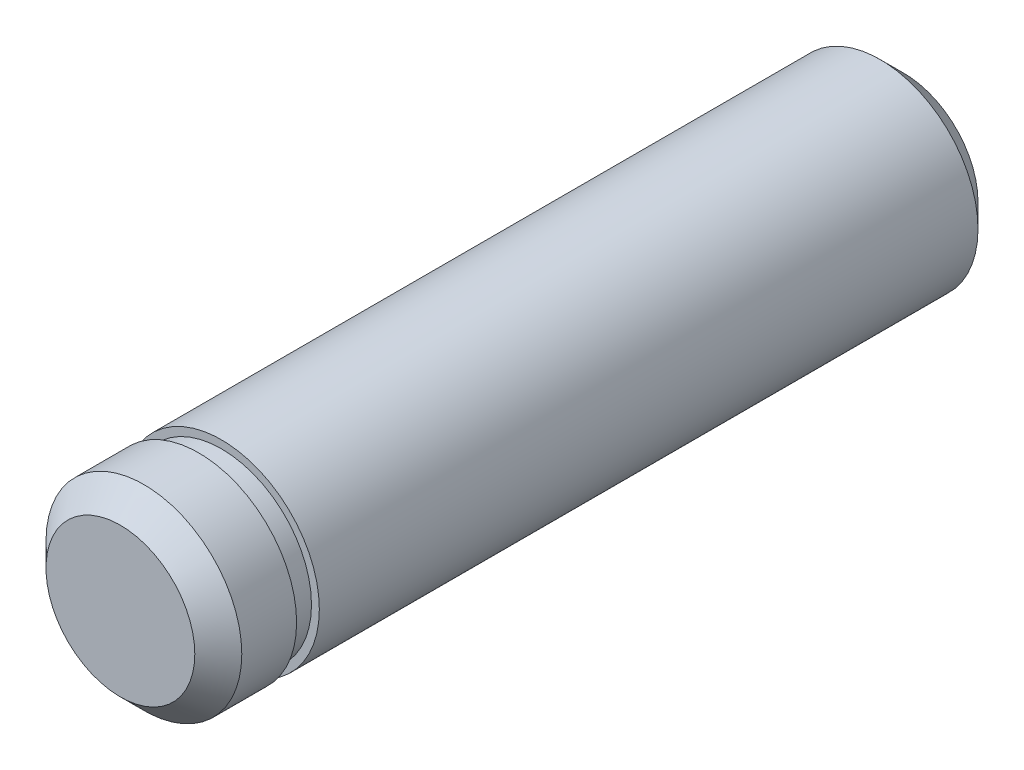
ISO-10303-21;
HEADER;
FILE_DESCRIPTION(('STEP AP214'),'2;1');
FILE_NAME('part.step','',(''),(''),'','','');
FILE_SCHEMA(('AUTOMOTIVE_DESIGN { 1 0 10303 214 1 1 1 1 }'));
ENDSEC;
DATA;
#1=APPLICATION_CONTEXT('core data for automotive mechanical design processes');
#2=APPLICATION_PROTOCOL_DEFINITION('international standard','automotive_design',2000,#1);
#3=PRODUCT_CONTEXT('',#1,'mechanical');
#4=PRODUCT('Part','Part','',(#3));
#5=PRODUCT_RELATED_PRODUCT_CATEGORY('part','',(#4));
#6=PRODUCT_DEFINITION_FORMATION('','',#4);
#7=PRODUCT_DEFINITION_CONTEXT('part definition',#1,'design');
#8=PRODUCT_DEFINITION('design','',#6,#7);
#9=PRODUCT_DEFINITION_SHAPE('','',#8);
#10=(LENGTH_UNIT() NAMED_UNIT(*) SI_UNIT(.MILLI.,.METRE.));
#11=(NAMED_UNIT(*) PLANE_ANGLE_UNIT() SI_UNIT($,.RADIAN.));
#12=(NAMED_UNIT(*) SI_UNIT($,.STERADIAN.) SOLID_ANGLE_UNIT());
#13=UNCERTAINTY_MEASURE_WITH_UNIT(LENGTH_MEASURE(1.E-05),#10,'distance_accuracy_value','');
#14=(GEOMETRIC_REPRESENTATION_CONTEXT(3) GLOBAL_UNCERTAINTY_ASSIGNED_CONTEXT((#13)) GLOBAL_UNIT_ASSIGNED_CONTEXT((#10,
#11,#12)) REPRESENTATION_CONTEXT('',''));
#15=CARTESIAN_POINT('',(0.,0.,0.));
#16=DIRECTION('',(0.,0.,1.));
#17=DIRECTION('',(1.,0.,0.));
#18=AXIS2_PLACEMENT_3D('',#15,#16,#17);
#19=CARTESIAN_POINT('',(0.,0.,25.4));
#20=DIRECTION('',(0.,0.,-1.));
#21=DIRECTION('',(-1.,0.,0.));
#22=AXIS2_PLACEMENT_3D('',#19,#20,#21);
#23=CYLINDRICAL_SURFACE('',#22,3.175);
#24=CARTESIAN_POINT('',(0.,0.,0.762000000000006));
#25=DIRECTION('',(0.,0.,1.));
#26=DIRECTION('',(1.,0.,0.));
#27=AXIS2_PLACEMENT_3D('',#24,#25,#26);
#28=CIRCLE('',#27,3.175);
#29=CARTESIAN_POINT('',(3.175,0.,0.762000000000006));
#30=VERTEX_POINT('',#29);
#31=EDGE_CURVE('E40',#30,#30,#28,.T.);
#32=ORIENTED_EDGE('',*,*,#31,.T.);
#33=EDGE_LOOP('',(#32));
#34=FACE_BOUND('',#33,.T.);
#35=CARTESIAN_POINT('',(0.,0.,22.1234));
#36=DIRECTION('',(0.,0.,1.));
#37=DIRECTION('',(1.,0.,0.));
#38=AXIS2_PLACEMENT_3D('',#35,#36,#37);
#39=CIRCLE('',#38,3.175);
#40=CARTESIAN_POINT('',(3.175,0.,22.1234));
#41=VERTEX_POINT('',#40);
#42=EDGE_CURVE('E49',#41,#41,#39,.T.);
#43=ORIENTED_EDGE('',*,*,#42,.F.);
#44=EDGE_LOOP('',(#43));
#45=FACE_BOUND('',#44,.T.);
#46=ADVANCED_FACE('F29',(#34,#45),#23,.T.);
#47=CARTESIAN_POINT('',(0.,0.,0.));
#48=DIRECTION('',(0.,0.,1.));
#49=DIRECTION('',(1.,0.,0.));
#50=AXIS2_PLACEMENT_3D('',#47,#48,#49);
#51=PLANE('',#50);
#52=CARTESIAN_POINT('',(0.,0.,0.));
#53=DIRECTION('',(0.,0.,1.));
#54=DIRECTION('',(1.,0.,0.));
#55=AXIS2_PLACEMENT_3D('',#52,#53,#54);
#56=CIRCLE('',#55,2.41299999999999);
#57=CARTESIAN_POINT('',(2.41299999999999,0.,0.));
#58=VERTEX_POINT('',#57);
#59=EDGE_CURVE('E10',#58,#58,#56,.F.);
#60=ORIENTED_EDGE('',*,*,#59,.T.);
#61=EDGE_LOOP('',(#60));
#62=FACE_BOUND('',#61,.T.);
#63=ADVANCED_FACE('F73',(#62),#51,.F.);
#64=CARTESIAN_POINT('',(0.,0.,0.762000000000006));
#65=DIRECTION('',(0.,0.,1.));
#66=DIRECTION('',(1.,0.,0.));
#67=AXIS2_PLACEMENT_3D('',#64,#65,#66);
#68=CONICAL_SURFACE('',#67,3.175,0.785398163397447);
#69=ORIENTED_EDGE('',*,*,#59,.F.);
#70=EDGE_LOOP('',(#69));
#71=FACE_BOUND('',#70,.T.);
#72=ORIENTED_EDGE('',*,*,#31,.F.);
#73=EDGE_LOOP('',(#72));
#74=FACE_BOUND('',#73,.T.);
#75=ADVANCED_FACE('F31',(#71,#74),#68,.T.);
#76=CARTESIAN_POINT('',(0.,0.,22.1234));
#77=DIRECTION('',(0.,0.,1.));
#78=DIRECTION('',(1.,0.,0.));
#79=AXIS2_PLACEMENT_3D('',#76,#77,#78);
#80=PLANE('',#79);
#81=CARTESIAN_POINT('',(0.,0.,22.1234));
#82=DIRECTION('',(0.,0.,1.));
#83=DIRECTION('',(1.,0.,0.));
#84=AXIS2_PLACEMENT_3D('',#81,#82,#83);
#85=CIRCLE('',#84,2.921);
#86=CARTESIAN_POINT('',(2.921,0.,22.1234));
#87=VERTEX_POINT('',#86);
#88=EDGE_CURVE('E53',#87,#87,#85,.T.);
#89=ORIENTED_EDGE('',*,*,#88,.F.);
#90=EDGE_LOOP('',(#89));
#91=FACE_BOUND('',#90,.T.);
#92=ORIENTED_EDGE('',*,*,#42,.T.);
#93=EDGE_LOOP('',(#92));
#94=FACE_BOUND('',#93,.T.);
#95=ADVANCED_FACE('F65',(#91,#94),#80,.T.);
#96=CARTESIAN_POINT('',(0.,0.,22.86));
#97=DIRECTION('',(0.,0.,1.));
#98=DIRECTION('',(1.,0.,0.));
#99=AXIS2_PLACEMENT_3D('',#96,#97,#98);
#100=PLANE('',#99);
#101=CARTESIAN_POINT('',(0.,0.,22.86));
#102=DIRECTION('',(0.,0.,1.));
#103=DIRECTION('',(1.,0.,0.));
#104=AXIS2_PLACEMENT_3D('',#101,#102,#103);
#105=CIRCLE('',#104,2.921);
#106=CARTESIAN_POINT('',(2.921,0.,22.86));
#107=VERTEX_POINT('',#106);
#108=EDGE_CURVE('E56',#107,#107,#105,.T.);
#109=ORIENTED_EDGE('',*,*,#108,.T.);
#110=EDGE_LOOP('',(#109));
#111=FACE_BOUND('',#110,.T.);
#112=CARTESIAN_POINT('',(0.,0.,22.86));
#113=DIRECTION('',(0.,0.,1.));
#114=DIRECTION('',(1.,0.,0.));
#115=AXIS2_PLACEMENT_3D('',#112,#113,#114);
#116=CIRCLE('',#115,3.175);
#117=CARTESIAN_POINT('',(3.175,0.,22.86));
#118=VERTEX_POINT('',#117);
#119=EDGE_CURVE('E50',#118,#118,#116,.T.);
#120=ORIENTED_EDGE('',*,*,#119,.F.);
#121=EDGE_LOOP('',(#120));
#122=FACE_BOUND('',#121,.T.);
#123=ADVANCED_FACE('F68',(#111,#122),#100,.F.);
#124=CARTESIAN_POINT('',(0.,0.,22.1234));
#125=DIRECTION('',(0.,0.,1.));
#126=DIRECTION('',(1.,0.,0.));
#127=AXIS2_PLACEMENT_3D('',#124,#125,#126);
#128=CYLINDRICAL_SURFACE('',#127,2.921);
#129=ORIENTED_EDGE('',*,*,#88,.T.);
#130=EDGE_LOOP('',(#129));
#131=FACE_BOUND('',#130,.T.);
#132=ORIENTED_EDGE('',*,*,#108,.F.);
#133=EDGE_LOOP('',(#132));
#134=FACE_BOUND('',#133,.T.);
#135=ADVANCED_FACE('F62',(#131,#134),#128,.T.);
#136=CARTESIAN_POINT('',(0.,0.,25.4));
#137=DIRECTION('',(0.,0.,1.));
#138=DIRECTION('',(1.,0.,0.));
#139=AXIS2_PLACEMENT_3D('',#136,#137,#138);
#140=PLANE('',#139);
#141=CARTESIAN_POINT('',(0.,0.,25.4));
#142=DIRECTION('',(0.,0.,1.));
#143=DIRECTION('',(1.,0.,0.));
#144=AXIS2_PLACEMENT_3D('',#141,#142,#143);
#145=CIRCLE('',#144,2.41300000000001);
#146=CARTESIAN_POINT('',(2.41300000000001,0.,25.4));
#147=VERTEX_POINT('',#146);
#148=EDGE_CURVE('E44',#147,#147,#145,.T.);
#149=ORIENTED_EDGE('',*,*,#148,.T.);
#150=EDGE_LOOP('',(#149));
#151=FACE_BOUND('',#150,.T.);
#152=ADVANCED_FACE('F87',(#151),#140,.T.);
#153=CARTESIAN_POINT('',(0.,0.,25.4));
#154=DIRECTION('',(0.,0.,-1.));
#155=DIRECTION('',(-1.,0.,0.));
#156=AXIS2_PLACEMENT_3D('',#153,#154,#155);
#157=CONICAL_SURFACE('',#156,2.41300000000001,0.785398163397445);
#158=CARTESIAN_POINT('',(0.,0.,24.638));
#159=DIRECTION('',(0.,0.,1.));
#160=DIRECTION('',(1.,0.,0.));
#161=AXIS2_PLACEMENT_3D('',#158,#159,#160);
#162=CIRCLE('',#161,3.175);
#163=CARTESIAN_POINT('',(3.175,0.,24.638));
#164=VERTEX_POINT('',#163);
#165=EDGE_CURVE('E36',#164,#164,#162,.F.);
#166=ORIENTED_EDGE('',*,*,#165,.F.);
#167=EDGE_LOOP('',(#166));
#168=FACE_BOUND('',#167,.T.);
#169=ORIENTED_EDGE('',*,*,#148,.F.);
#170=EDGE_LOOP('',(#169));
#171=FACE_BOUND('',#170,.T.);
#172=ADVANCED_FACE('F82',(#168,#171),#157,.T.);
#173=ORIENTED_EDGE('',*,*,#119,.T.);
#174=EDGE_LOOP('',(#173));
#175=FACE_BOUND('',#174,.T.);
#176=ORIENTED_EDGE('',*,*,#165,.T.);
#177=EDGE_LOOP('',(#176));
#178=FACE_BOUND('',#177,.T.);
#179=ADVANCED_FACE('F76',(#175,#178),#23,.T.);
#180=CLOSED_SHELL('',(#46,#63,#75,#95,#123,#135,#152,#172,#179));
#181=MANIFOLD_SOLID_BREP('B2',#180);
#182=ADVANCED_BREP_SHAPE_REPRESENTATION('',(#18,#181),#14);
#183=SHAPE_DEFINITION_REPRESENTATION(#9,#182);
ENDSEC;
END-ISO-10303-21;
